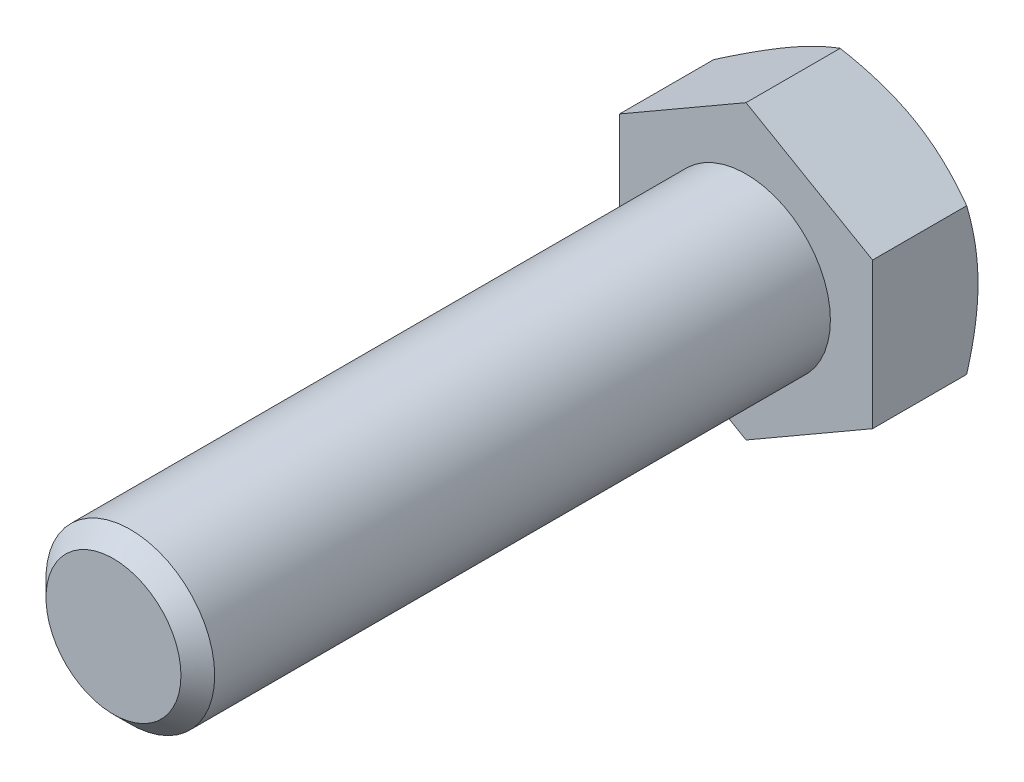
ISO-10303-21;
HEADER;
FILE_DESCRIPTION(('STEP AP214'),'2;1');
FILE_NAME('part.step','',(''),(''),'','','');
FILE_SCHEMA(('AUTOMOTIVE_DESIGN { 1 0 10303 214 1 1 1 1 }'));
ENDSEC;
DATA;
#1=APPLICATION_CONTEXT('core data for automotive mechanical design processes');
#2=APPLICATION_PROTOCOL_DEFINITION('international standard','automotive_design',2000,#1);
#3=PRODUCT_CONTEXT('',#1,'mechanical');
#4=PRODUCT('Part','Part','',(#3));
#5=PRODUCT_RELATED_PRODUCT_CATEGORY('part','',(#4));
#6=PRODUCT_DEFINITION_FORMATION('','',#4);
#7=PRODUCT_DEFINITION_CONTEXT('part definition',#1,'design');
#8=PRODUCT_DEFINITION('design','',#6,#7);
#9=PRODUCT_DEFINITION_SHAPE('','',#8);
#10=(LENGTH_UNIT() NAMED_UNIT(*) SI_UNIT(.MILLI.,.METRE.));
#11=(NAMED_UNIT(*) PLANE_ANGLE_UNIT() SI_UNIT($,.RADIAN.));
#12=(NAMED_UNIT(*) SI_UNIT($,.STERADIAN.) SOLID_ANGLE_UNIT());
#13=UNCERTAINTY_MEASURE_WITH_UNIT(LENGTH_MEASURE(1.E-05),#10,'distance_accuracy_value','');
#14=(GEOMETRIC_REPRESENTATION_CONTEXT(3) GLOBAL_UNCERTAINTY_ASSIGNED_CONTEXT((#13)) GLOBAL_UNIT_ASSIGNED_CONTEXT((#10,
#11,#12)) REPRESENTATION_CONTEXT('',''));
#15=CARTESIAN_POINT('',(0.,0.,0.));
#16=DIRECTION('',(0.,0.,1.));
#17=DIRECTION('',(1.,0.,0.));
#18=AXIS2_PLACEMENT_3D('',#15,#16,#17);
#19=CARTESIAN_POINT('',(-2.22044604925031E-13,1.94289029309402E-13,60.0000000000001));
#20=DIRECTION('',(0.,0.,1.));
#21=DIRECTION('',(1.,0.,0.));
#22=AXIS2_PLACEMENT_3D('',#19,#20,#21);
#23=PLANE('',#22);
#24=CARTESIAN_POINT('',(-2.22044604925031E-13,1.94289029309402E-13,60.0000000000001));
#25=DIRECTION('',(0.,0.,1.));
#26=DIRECTION('',(1.,0.,0.));
#27=AXIS2_PLACEMENT_3D('',#24,#25,#26);
#28=CIRCLE('',#27,6.40000000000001);
#29=CARTESIAN_POINT('',(6.39999999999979,1.90736315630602E-13,60.0000000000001));
#30=VERTEX_POINT('',#29);
#31=EDGE_CURVE('E204',#30,#30,#28,.T.);
#32=ORIENTED_EDGE('',*,*,#31,.T.);
#33=EDGE_LOOP('',(#32));
#34=FACE_BOUND('',#33,.T.);
#35=ADVANCED_FACE('F30',(#34),#23,.T.);
#36=CARTESIAN_POINT('',(0.,0.,0.));
#37=DIRECTION('',(0.,0.,1.));
#38=DIRECTION('',(1.,0.,0.));
#39=AXIS2_PLACEMENT_3D('',#36,#37,#38);
#40=CYLINDRICAL_SURFACE('',#39,8.);
#41=CARTESIAN_POINT('',(-1.11022302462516E-13,1.66533453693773E-13,58.4000000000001));
#42=DIRECTION('',(0.,0.,1.));
#43=DIRECTION('',(1.,0.,0.));
#44=AXIS2_PLACEMENT_3D('',#41,#42,#43);
#45=CIRCLE('',#44,8.);
#46=CARTESIAN_POINT('',(7.99999999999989,1.62092561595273E-13,58.4000000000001));
#47=VERTEX_POINT('',#46);
#48=EDGE_CURVE('E206',#47,#47,#45,.F.);
#49=ORIENTED_EDGE('',*,*,#48,.T.);
#50=EDGE_LOOP('',(#49));
#51=FACE_BOUND('',#50,.T.);
#52=CARTESIAN_POINT('',(0.,0.,0.));
#53=DIRECTION('',(0.,0.,1.));
#54=DIRECTION('',(0.999999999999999,0.,0.));
#55=AXIS2_PLACEMENT_3D('',#52,#53,#54);
#56=CIRCLE('',#55,8.);
#57=CARTESIAN_POINT('',(7.99999999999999,0.,0.));
#58=VERTEX_POINT('',#57);
#59=EDGE_CURVE('E207',#58,#58,#56,.F.);
#60=ORIENTED_EDGE('',*,*,#59,.F.);
#61=EDGE_LOOP('',(#60));
#62=FACE_BOUND('',#61,.T.);
#63=ADVANCED_FACE('F195',(#51,#62),#40,.T.);
#64=CARTESIAN_POINT('',(-2.22044604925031E-13,1.94289029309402E-13,60.0000000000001));
#65=DIRECTION('',(0.,0.,-1.));
#66=DIRECTION('',(-1.,0.,0.));
#67=AXIS2_PLACEMENT_3D('',#64,#65,#66);
#68=CONICAL_SURFACE('',#67,6.40000000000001,0.785398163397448);
#69=ORIENTED_EDGE('',*,*,#48,.F.);
#70=EDGE_LOOP('',(#69));
#71=FACE_BOUND('',#70,.T.);
#72=ORIENTED_EDGE('',*,*,#31,.F.);
#73=EDGE_LOOP('',(#72));
#74=FACE_BOUND('',#73,.T.);
#75=ADVANCED_FACE('F200',(#71,#74),#68,.T.);
#76=CARTESIAN_POINT('',(-2.22044604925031E-13,13.856406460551,-10.0000000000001));
#77=DIRECTION('',(0.499999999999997,0.86602540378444,0.));
#78=DIRECTION('',(-0.866025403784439,0.499999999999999,0.));
#79=AXIS2_PLACEMENT_3D('',#76,#77,#78);
#80=PLANE('',#79);
#81=CARTESIAN_POINT('',(-0.000200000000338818,13.8565219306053,-8.9281365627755));
#82=CARTESIAN_POINT('',(0.263585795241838,13.7042251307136,-9.01605036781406));
#83=CARTESIAN_POINT('',(0.528355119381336,13.5513604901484,-9.09997400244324));
#84=CARTESIAN_POINT('',(1.06001701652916,13.2444053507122,-9.25873378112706));
#85=CARTESIAN_POINT('',(1.32691025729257,13.0903144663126,-9.33356693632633));
#86=CARTESIAN_POINT('',(2.1318904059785,12.6255589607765,-9.54298246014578));
#87=CARTESIAN_POINT('',(2.67315507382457,12.3130596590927,-9.66209676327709));
#88=CARTESIAN_POINT('',(3.48313282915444,11.8454187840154,-9.80176893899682));
#89=CARTESIAN_POINT('',(3.74942610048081,11.6916742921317,-9.84155620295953));
#90=CARTESIAN_POINT('',(4.28324559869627,11.3834734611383,-9.90827663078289));
#91=CARTESIAN_POINT('',(4.5507718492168,11.229017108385,-9.93520954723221));
#92=CARTESIAN_POINT('',(5.08627036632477,10.9198468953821,-9.97553140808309));
#93=CARTESIAN_POINT('',(5.35424172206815,10.7651335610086,-9.98893644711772));
#94=CARTESIAN_POINT('',(5.89043273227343,10.4555635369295,-10.0019169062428));
#95=CARTESIAN_POINT('',(6.15865237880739,10.3007068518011,-10.0014927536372));
#96=CARTESIAN_POINT('',(6.66008937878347,10.0112020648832,-9.98777998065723));
#97=CARTESIAN_POINT('',(6.89334249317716,9.87653331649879,-9.97616401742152));
#98=CARTESIAN_POINT('',(7.35931224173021,9.60750555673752,-9.94269199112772));
#99=CARTESIAN_POINT('',(7.59202883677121,9.47314656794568,-9.92083520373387));
#100=CARTESIAN_POINT('',(8.0567990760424,9.20481134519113,-9.86726258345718));
#101=CARTESIAN_POINT('',(8.28885201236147,9.07083551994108,-9.83553860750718));
#102=CARTESIAN_POINT('',(8.75186996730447,8.80351197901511,-9.76278822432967));
#103=CARTESIAN_POINT('',(8.98283491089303,8.67016430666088,-9.72176118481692));
#104=CARTESIAN_POINT('',(9.68394195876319,8.26537996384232,-9.58368834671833));
#105=CARTESIAN_POINT('',(10.1520537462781,7.99511549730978,-9.47287511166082));
#106=CARTESIAN_POINT('',(11.081297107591,7.45861659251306,-9.22137423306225));
#107=CARTESIAN_POINT('',(11.5424405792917,7.19237528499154,-9.08074565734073));
#108=CARTESIAN_POINT('',(12.0001999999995,6.92808776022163,-8.92813656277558));
#109=B_SPLINE_CURVE_WITH_KNOTS('',3,(#81,#82,#83,#84,#85,#86,#87,#88,#89,#90,#91,#92,#93,#94,
#95,#96,#97,#98,#99,#100,#101,#102,#103,#104,#105,#106,#107,#108),.UNSPECIFIED.,.F.,.F.,(4,2,2,
2,2,2,2,2,2,2,2,2,2,4),(0.,0.951004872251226,1.90232158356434,3.8090046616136,4.73894551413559,
5.66890426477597,6.59775529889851,7.52657763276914,8.33514643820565,9.14377244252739,
9.95306755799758,10.7624176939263,12.4167102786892,14.0677556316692),.UNSPECIFIED.);
#110=CARTESIAN_POINT('',(-1.11022302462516E-13,13.856406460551,-8.92820323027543));
#111=VERTEX_POINT('',#110);
#112=CARTESIAN_POINT('',(5.99999999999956,10.3923048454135,-10.0000000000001));
#113=VERTEX_POINT('',#112);
#114=EDGE_CURVE('E240',#111,#113,#109,.T.);
#115=ORIENTED_EDGE('',*,*,#114,.F.);
#116=DIRECTION('',(0.,0.,1.));
#117=VECTOR('',#116,1.);
#118=CARTESIAN_POINT('',(-2.22044604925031E-13,13.856406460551,-10.0000000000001));
#119=LINE('',#118,#117);
#120=CARTESIAN_POINT('',(0.,13.856406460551,1.11022302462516E-13));
#121=VERTEX_POINT('',#120);
#122=EDGE_CURVE('E214',#111,#121,#119,.T.);
#123=ORIENTED_EDGE('',*,*,#122,.T.);
#124=DIRECTION('',(-0.866025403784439,0.499999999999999,0.));
#125=VECTOR('',#124,1.);
#126=CARTESIAN_POINT('',(0.,13.856406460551,1.11022302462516E-13));
#127=LINE('',#126,#125);
#128=CARTESIAN_POINT('',(11.9999999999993,6.92820323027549,0.));
#129=VERTEX_POINT('',#128);
#130=EDGE_CURVE('E238',#129,#121,#127,.T.);
#131=ORIENTED_EDGE('',*,*,#130,.F.);
#132=DIRECTION('',(0.,0.,1.));
#133=VECTOR('',#132,1.);
#134=CARTESIAN_POINT('',(11.9999999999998,6.92820323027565,-10.0000000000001));
#135=LINE('',#134,#133);
#136=CARTESIAN_POINT('',(11.9999999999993,6.92820323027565,-8.92820323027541));
#137=VERTEX_POINT('',#136);
#138=EDGE_CURVE('E211',#137,#129,#135,.T.);
#139=ORIENTED_EDGE('',*,*,#138,.F.);
#140=EDGE_CURVE('E170',#113,#137,#109,.T.);
#141=ORIENTED_EDGE('',*,*,#140,.F.);
#142=EDGE_LOOP('',(#115,#123,#131,#139,#141));
#143=FACE_BOUND('',#142,.T.);
#144=ADVANCED_FACE('F180',(#143),#80,.T.);
#145=CARTESIAN_POINT('',(11.9999999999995,-6.92820323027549,-10.0000000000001));
#146=DIRECTION('',(0.999999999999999,0.,0.));
#147=DIRECTION('',(0.,0.,-1.));
#148=AXIS2_PLACEMENT_3D('',#145,#146,#147);
#149=PLANE('',#148);
#150=CARTESIAN_POINT('',(11.9999999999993,-18.9250739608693,-3.9904236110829));
#151=CARTESIAN_POINT('',(11.9999999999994,-18.6616294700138,-4.11887459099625));
#152=CARTESIAN_POINT('',(11.9999999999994,-18.3978841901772,-4.24670838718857));
#153=CARTESIAN_POINT('',(11.9999999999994,-17.8697293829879,-4.50100240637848));
#154=CARTESIAN_POINT('',(11.9999999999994,-17.6053198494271,-4.62746261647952));
#155=CARTESIAN_POINT('',(11.9999999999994,-16.8109346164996,-5.00460542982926));
#156=CARTESIAN_POINT('',(11.9999999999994,-16.279875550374,-5.2530143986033));
#157=CARTESIAN_POINT('',(11.9999999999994,-15.2115652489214,-5.74359590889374));
#158=CARTESIAN_POINT('',(11.9999999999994,-14.6742962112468,-5.98572977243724));
#159=CARTESIAN_POINT('',(11.9999999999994,-13.5955935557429,-6.4605025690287));
#160=CARTESIAN_POINT('',(11.9999999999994,-13.0541601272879,-6.69314193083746));
#161=CARTESIAN_POINT('',(11.9999999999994,-11.9477551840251,-7.1541366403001));
#162=CARTESIAN_POINT('',(11.9999999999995,-11.3826097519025,-7.38207667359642));
#163=CARTESIAN_POINT('',(11.9999999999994,-10.2458209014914,-7.82145679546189));
#164=CARTESIAN_POINT('',(11.9999999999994,-9.67417677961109,-8.0328950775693));
#165=CARTESIAN_POINT('',(11.9999999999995,-8.52447018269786,-8.43394793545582));
#166=CARTESIAN_POINT('',(11.9999999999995,-7.94642231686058,-8.62360406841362));
#167=CARTESIAN_POINT('',(11.9999999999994,-6.78198793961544,-8.97522909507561));
#168=CARTESIAN_POINT('',(11.9999999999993,-6.1956040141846,-9.13720638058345));
#169=CARTESIAN_POINT('',(11.9999999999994,-5.31125301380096,-9.35327296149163));
#170=CARTESIAN_POINT('',(11.9999999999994,-5.0165168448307,-9.42065839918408));
#171=CARTESIAN_POINT('',(11.9999999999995,-4.42497462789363,-9.54568693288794));
#172=CARTESIAN_POINT('',(11.9999999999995,-4.12816861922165,-9.60333021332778));
#173=CARTESIAN_POINT('',(11.9999999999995,-3.53266972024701,-9.70787722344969));
#174=CARTESIAN_POINT('',(11.9999999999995,-3.23397688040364,-9.75478123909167));
#175=CARTESIAN_POINT('',(11.9999999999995,-2.63499315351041,-9.83692742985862));
#176=CARTESIAN_POINT('',(11.9999999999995,-2.33470233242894,-9.87217008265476));
#177=CARTESIAN_POINT('',(11.9999999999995,-1.73700046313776,-9.92983318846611));
#178=CARTESIAN_POINT('',(11.9999999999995,-1.43960568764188,-9.9524212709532));
#179=CARTESIAN_POINT('',(11.9999999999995,-0.844126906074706,-9.98498816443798));
#180=CARTESIAN_POINT('',(11.9999999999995,-0.54604291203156,-9.99496719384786));
#181=CARTESIAN_POINT('',(11.9999999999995,0.0502829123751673,-10.0020768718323));
#182=CARTESIAN_POINT('',(11.9999999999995,0.348524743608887,-9.9992074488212));
#183=CARTESIAN_POINT('',(11.9999999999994,0.944614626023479,-9.98069357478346));
#184=CARTESIAN_POINT('',(11.9999999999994,1.24246265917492,-9.96504855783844));
#185=CARTESIAN_POINT('',(11.9999999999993,1.94883669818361,-9.91313385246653));
#186=CARTESIAN_POINT('',(11.9999999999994,2.35696532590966,-9.87132867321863));
#187=CARTESIAN_POINT('',(11.9999999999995,3.17037872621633,-9.76594124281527));
#188=CARTESIAN_POINT('',(11.9999999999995,3.57566314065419,-9.70235629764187));
#189=CARTESIAN_POINT('',(11.9999999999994,4.7866711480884,-9.48228853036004));
#190=CARTESIAN_POINT('',(11.9999999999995,5.58715478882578,-9.296525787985));
#191=CARTESIAN_POINT('',(11.9999999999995,6.78477534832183,-8.97197381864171));
#192=CARTESIAN_POINT('',(11.9999999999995,7.18805346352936,-8.85452170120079));
#193=CARTESIAN_POINT('',(11.9999999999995,7.99069893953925,-8.60681919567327));
#194=CARTESIAN_POINT('',(11.9999999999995,8.39006626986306,-8.47656870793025));
#195=CARTESIAN_POINT('',(11.9999999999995,9.1850074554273,-8.20540698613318));
#196=CARTESIAN_POINT('',(11.9999999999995,9.58058232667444,-8.06449870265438));
#197=CARTESIAN_POINT('',(11.9999999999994,10.3684152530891,-7.77374558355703));
#198=CARTESIAN_POINT('',(11.9999999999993,10.7606733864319,-7.62390095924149));
#199=CARTESIAN_POINT('',(11.9999999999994,11.4875161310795,-7.33823544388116));
#200=CARTESIAN_POINT('',(11.9999999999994,11.8224853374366,-7.20338895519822));
#201=CARTESIAN_POINT('',(11.9999999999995,12.4904657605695,-6.92892402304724));
#202=CARTESIAN_POINT('',(11.9999999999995,12.8234769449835,-6.78930550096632));
#203=CARTESIAN_POINT('',(11.9999999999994,13.8199414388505,-6.36427464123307));
#204=CARTESIAN_POINT('',(11.9999999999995,14.480771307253,-6.07270863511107));
#205=CARTESIAN_POINT('',(11.9999999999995,15.7970784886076,-5.47713534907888));
#206=CARTESIAN_POINT('',(11.9999999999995,16.4525535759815,-5.17312318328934));
#207=CARTESIAN_POINT('',(11.9999999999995,17.7589886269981,-4.555639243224));
#208=CARTESIAN_POINT('',(11.9999999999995,18.4099487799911,-4.24216786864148));
#209=CARTESIAN_POINT('',(11.9999999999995,19.7093218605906,-3.60732416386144));
#210=CARTESIAN_POINT('',(11.9999999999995,20.3577288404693,-3.28593969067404));
#211=CARTESIAN_POINT('',(11.9999999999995,21.6516057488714,-2.63730730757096));
#212=CARTESIAN_POINT('',(11.9999999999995,22.2970756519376,-2.31005934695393));
#213=CARTESIAN_POINT('',(11.9999999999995,23.5854613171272,-1.65093387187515));
#214=CARTESIAN_POINT('',(11.9999999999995,24.2283776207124,-1.31905741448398));
#215=CARTESIAN_POINT('',(11.9999999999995,25.5122149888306,-0.651476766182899));
#216=CARTESIAN_POINT('',(11.9999999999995,26.1531360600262,-0.315772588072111));
#217=CARTESIAN_POINT('',(11.9999999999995,27.936282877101,0.623783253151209));
#218=CARTESIAN_POINT('',(11.9999999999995,29.0767003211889,1.23106608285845));
#219=CARTESIAN_POINT('',(11.9999999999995,31.3537253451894,2.4528894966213));
#220=CARTESIAN_POINT('',(11.9999999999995,32.4903326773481,3.06743054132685));
#221=CARTESIAN_POINT('',(11.9999999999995,34.7567241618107,4.29980771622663));
#222=CARTESIAN_POINT('',(11.9999999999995,35.8865183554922,4.91762539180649));
#223=CARTESIAN_POINT('',(11.9999999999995,37.5794668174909,5.84741408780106));
#224=CARTESIAN_POINT('',(11.9999999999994,38.1434699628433,6.15784153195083));
#225=CARTESIAN_POINT('',(11.9999999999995,39.2709710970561,6.77961088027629));
#226=CARTESIAN_POINT('',(11.9999999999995,39.8344690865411,7.09095278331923));
#227=CARTESIAN_POINT('',(11.9999999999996,40.3977455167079,7.40269511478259));
#228=B_SPLINE_CURVE_WITH_KNOTS('',3,(#150,#151,#152,#153,#154,#155,#156,#157,#158,#159,#160,
#161,#162,#163,#164,#165,#166,#167,#168,#169,#170,#171,#172,#173,#174,#175,#176,#177,#178,#179,
#180,#181,#182,#183,#184,#185,#186,#187,#188,#189,#190,#191,#192,#193,#194,#195,#196,#197,#198,
#199,#200,#201,#202,#203,#204,#205,#206,#207,#208,#209,#210,#211,#212,#213,#214,#215,#216,#217,
#218,#219,#220,#221,#222,#223,#224,#225,#226,#227),.UNSPECIFIED.,.F.,.F.,(4,2,2,2,2,2,2,2,2,2,2,
2,2,2,2,2,2,2,2,2,2,2,2,2,2,2,2,2,2,2,2,2,2,2,2,2,2,2,4),(0.,0.879273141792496,1.75855453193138,
3.51736195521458,5.28522162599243,7.05300137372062,8.88094951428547,10.7090974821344,
12.5336975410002,14.3577434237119,15.2646321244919,16.1715036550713,17.0783510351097,
17.9851612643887,18.8796567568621,19.7741367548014,20.6686217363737,21.5631463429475,
22.7932504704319,24.0235068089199,26.4852023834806,27.7451892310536,29.0051858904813,
30.2648349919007,31.5244543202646,32.6076922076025,33.6909479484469,35.8576349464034,
38.0251808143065,40.1926352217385,42.3636532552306,44.5346900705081,46.7052389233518,
48.8757805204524,52.75183297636,56.6281327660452,60.4911769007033,62.4225443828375,
64.3539094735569),.UNSPECIFIED.);
#229=CARTESIAN_POINT('',(11.9999999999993,4.9960036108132E-13,-9.99999999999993));
#230=VERTEX_POINT('',#229);
#231=EDGE_CURVE('E168',#137,#230,#228,.F.);
#232=ORIENTED_EDGE('',*,*,#231,.F.);
#233=ORIENTED_EDGE('',*,*,#138,.T.);
#234=DIRECTION('',(0.,1.,0.));
#235=VECTOR('',#234,1.);
#236=CARTESIAN_POINT('',(11.9999999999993,-6.92820323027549,0.));
#237=LINE('',#236,#235);
#238=CARTESIAN_POINT('',(11.9999999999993,-6.92820323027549,0.));
#239=VERTEX_POINT('',#238);
#240=EDGE_CURVE('E216',#239,#129,#237,.T.);
#241=ORIENTED_EDGE('',*,*,#240,.F.);
#242=DIRECTION('',(0.,0.,1.));
#243=VECTOR('',#242,1.);
#244=CARTESIAN_POINT('',(11.9999999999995,-6.92820323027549,-10.0000000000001));
#245=LINE('',#244,#243);
#246=CARTESIAN_POINT('',(11.9999999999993,-6.92820323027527,-8.92820323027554));
#247=VERTEX_POINT('',#246);
#248=EDGE_CURVE('E222',#247,#239,#245,.T.);
#249=ORIENTED_EDGE('',*,*,#248,.F.);
#250=EDGE_CURVE('E163',#230,#247,#228,.F.);
#251=ORIENTED_EDGE('',*,*,#250,.F.);
#252=EDGE_LOOP('',(#232,#233,#241,#249,#251));
#253=FACE_BOUND('',#252,.T.);
#254=ADVANCED_FACE('F176',(#253),#149,.T.);
#255=CARTESIAN_POINT('',(-8.88178419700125E-13,-13.8564064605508,-10.));
#256=DIRECTION('',(0.499999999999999,-0.86602540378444,0.));
#257=DIRECTION('',(0.866025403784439,0.499999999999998,0.));
#258=AXIS2_PLACEMENT_3D('',#255,#256,#257);
#259=PLANE('',#258);
#260=CARTESIAN_POINT('',(12.0001999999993,-6.92808776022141,-8.92813656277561));
#261=CARTESIAN_POINT('',(11.7364142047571,-7.08038456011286,-9.01605036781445));
#262=CARTESIAN_POINT('',(11.4716448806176,-7.23324920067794,-9.09997400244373));
#263=CARTESIAN_POINT('',(10.9399829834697,-7.54020434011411,-9.25873378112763));
#264=CARTESIAN_POINT('',(10.6730897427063,-7.69429522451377,-9.33356693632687));
#265=CARTESIAN_POINT('',(9.86810959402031,-8.15905073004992,-9.54298246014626));
#266=CARTESIAN_POINT('',(9.32684492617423,-8.47155003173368,-9.66209676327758));
#267=CARTESIAN_POINT('',(8.51686717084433,-8.939190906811,-9.80176893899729));
#268=CARTESIAN_POINT('',(8.25057389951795,-9.09293539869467,-9.84155620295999));
#269=CARTESIAN_POINT('',(7.71675440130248,-9.40113622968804,-9.90827663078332));
#270=CARTESIAN_POINT('',(7.44922815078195,-9.55559258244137,-9.93520954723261));
#271=CARTESIAN_POINT('',(6.91372963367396,-9.86476279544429,-9.9755314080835));
#272=CARTESIAN_POINT('',(6.64575827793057,-10.0194761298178,-9.98893644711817));
#273=CARTESIAN_POINT('',(6.10956726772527,-10.329046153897,-10.0019169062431));
#274=CARTESIAN_POINT('',(5.8413476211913,-10.4839028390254,-10.0014927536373));
#275=CARTESIAN_POINT('',(5.33991062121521,-10.7734076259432,-9.98777998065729));
#276=CARTESIAN_POINT('',(5.10665750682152,-10.9080763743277,-9.97616401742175));
#277=CARTESIAN_POINT('',(4.64068775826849,-11.1771041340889,-9.94269199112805));
#278=CARTESIAN_POINT('',(4.4079711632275,-11.3114631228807,-9.92083520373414));
#279=CARTESIAN_POINT('',(3.94320092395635,-11.5797983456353,-9.86726258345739));
#280=CARTESIAN_POINT('',(3.71114798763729,-11.7137741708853,-9.83553860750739));
#281=CARTESIAN_POINT('',(3.24813003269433,-11.9810977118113,-9.76278822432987));
#282=CARTESIAN_POINT('',(3.01716508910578,-12.1144453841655,-9.72176118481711));
#283=CARTESIAN_POINT('',(2.31605804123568,-12.519229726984,-9.58368834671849));
#284=CARTESIAN_POINT('',(1.84794625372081,-12.7894941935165,-9.47287511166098));
#285=CARTESIAN_POINT('',(0.91870289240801,-13.3259930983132,-9.22137423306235));
#286=CARTESIAN_POINT('',(0.457559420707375,-13.5922344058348,-9.08074565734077));
#287=CARTESIAN_POINT('',(-0.000200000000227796,-13.8565219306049,-8.92813656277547));
#288=B_SPLINE_CURVE_WITH_KNOTS('',3,(#260,#261,#262,#263,#264,#265,#266,#267,#268,#269,#270,
#271,#272,#273,#274,#275,#276,#277,#278,#279,#280,#281,#282,#283,#284,#285,#286,#287),
.UNSPECIFIED.,.F.,.F.,(4,2,2,2,2,2,2,2,2,2,2,2,2,4),(0.,0.951004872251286,1.90232158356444,
3.80900466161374,4.73894551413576,5.66890426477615,6.59775529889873,7.52657763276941,
8.33514643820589,9.14377244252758,9.95306755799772,10.7624176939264,12.4167102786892,
14.0677556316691),.UNSPECIFIED.);
#289=CARTESIAN_POINT('',(5.99999999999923,-10.3923048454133,-10.));
#290=VERTEX_POINT('',#289);
#291=EDGE_CURVE('E169',#247,#290,#288,.T.);
#292=ORIENTED_EDGE('',*,*,#291,.F.);
#293=ORIENTED_EDGE('',*,*,#248,.T.);
#294=DIRECTION('',(0.866025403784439,0.499999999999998,0.));
#295=VECTOR('',#294,1.);
#296=CARTESIAN_POINT('',(-6.66133814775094E-13,-13.8564064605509,0.));
#297=LINE('',#296,#295);
#298=CARTESIAN_POINT('',(-6.66133814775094E-13,-13.8564064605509,0.));
#299=VERTEX_POINT('',#298);
#300=EDGE_CURVE('E227',#299,#239,#297,.T.);
#301=ORIENTED_EDGE('',*,*,#300,.F.);
#302=DIRECTION('',(0.,0.,1.));
#303=VECTOR('',#302,1.);
#304=CARTESIAN_POINT('',(-8.88178419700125E-13,-13.8564064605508,-10.));
#305=LINE('',#304,#303);
#306=CARTESIAN_POINT('',(-6.66133814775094E-13,-13.8564064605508,-8.92820323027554));
#307=VERTEX_POINT('',#306);
#308=EDGE_CURVE('E220',#307,#299,#305,.T.);
#309=ORIENTED_EDGE('',*,*,#308,.F.);
#310=EDGE_CURVE('E157',#290,#307,#288,.T.);
#311=ORIENTED_EDGE('',*,*,#310,.F.);
#312=EDGE_LOOP('',(#292,#293,#301,#309,#311));
#313=FACE_BOUND('',#312,.T.);
#314=ADVANCED_FACE('F179',(#313),#259,.T.);
#315=CARTESIAN_POINT('',(-8.88178419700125E-13,-13.8564064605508,-10.));
#316=DIRECTION('',(-0.500000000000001,-0.866025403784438,0.));
#317=DIRECTION('',(0.866025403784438,-0.500000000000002,0.));
#318=AXIS2_PLACEMENT_3D('',#315,#316,#317);
#319=PLANE('',#318);
#320=CARTESIAN_POINT('',(0.000199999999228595,-13.8565219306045,-8.9281365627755));
#321=CARTESIAN_POINT('',(-0.263585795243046,-13.7042251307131,-9.01605036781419));
#322=CARTESIAN_POINT('',(-0.528355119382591,-13.551360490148,-9.09997400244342));
#323=CARTESIAN_POINT('',(-1.06001701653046,-13.2444053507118,-9.25873378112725));
#324=CARTESIAN_POINT('',(-1.32691025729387,-13.0903144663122,-9.33356693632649));
#325=CARTESIAN_POINT('',(-2.13189040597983,-12.625558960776,-9.54298246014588));
#326=CARTESIAN_POINT('',(-2.67315507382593,-12.3130596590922,-9.66209676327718));
#327=CARTESIAN_POINT('',(-3.48313282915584,-11.8454187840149,-9.80176893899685));
#328=CARTESIAN_POINT('',(-3.74942610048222,-11.6916742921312,-9.84155620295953));
#329=CARTESIAN_POINT('',(-4.2832455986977,-11.3834734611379,-9.90827663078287));
#330=CARTESIAN_POINT('',(-4.55077184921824,-11.2290171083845,-9.93520954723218));
#331=CARTESIAN_POINT('',(-5.08627036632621,-10.9198468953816,-9.97553140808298));
#332=CARTESIAN_POINT('',(-5.35424172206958,-10.765133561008,-9.98893644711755));
#333=CARTESIAN_POINT('',(-5.89043273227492,-10.455563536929,-10.0019169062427));
#334=CARTESIAN_POINT('',(-6.15865237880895,-10.3007068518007,-10.0014927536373));
#335=CARTESIAN_POINT('',(-6.66008937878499,-10.0112020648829,-9.9877799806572));
#336=CARTESIAN_POINT('',(-6.89334249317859,-9.87653331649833,-9.97616401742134));
#337=CARTESIAN_POINT('',(-7.35931224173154,-9.60750555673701,-9.9426919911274));
#338=CARTESIAN_POINT('',(-7.59202883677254,-9.47314656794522,-9.92083520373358));
#339=CARTESIAN_POINT('',(-8.05679907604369,-9.20481134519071,-9.86726258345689));
#340=CARTESIAN_POINT('',(-8.28885201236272,-9.07083551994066,-9.83553860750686));
#341=CARTESIAN_POINT('',(-8.75186996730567,-8.80351197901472,-9.76278822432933));
#342=CARTESIAN_POINT('',(-8.98283491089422,-8.6701643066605,-9.72176118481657));
#343=CARTESIAN_POINT('',(-9.6839419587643,-8.26537996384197,-9.58368834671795));
#344=CARTESIAN_POINT('',(-10.1520537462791,-7.99511549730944,-9.4728751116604));
#345=CARTESIAN_POINT('',(-11.081297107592,-7.45861659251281,-9.22137423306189));
#346=CARTESIAN_POINT('',(-11.5424405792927,-7.19237528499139,-9.08074565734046));
#347=CARTESIAN_POINT('',(-12.0002000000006,-6.92808776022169,-8.92813656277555));
#348=B_SPLINE_CURVE_WITH_KNOTS('',3,(#320,#321,#322,#323,#324,#325,#326,#327,#328,#329,#330,
#331,#332,#333,#334,#335,#336,#337,#338,#339,#340,#341,#342,#343,#344,#345,#346,#347),
.UNSPECIFIED.,.F.,.F.,(4,2,2,2,2,2,2,2,2,2,2,2,2,4),(0.,0.951004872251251,1.90232158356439,
3.80900466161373,4.73894551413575,5.66890426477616,6.59775529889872,7.52657763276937,
8.33514643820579,9.14377244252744,9.95306755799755,10.7624176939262,12.416710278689,
14.0677556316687),.UNSPECIFIED.);
#349=CARTESIAN_POINT('',(-6.00000000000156,-10.3923048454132,-9.99999999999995));
#350=VERTEX_POINT('',#349);
#351=EDGE_CURVE('E259',#307,#350,#348,.T.);
#352=ORIENTED_EDGE('',*,*,#351,.F.);
#353=ORIENTED_EDGE('',*,*,#308,.T.);
#354=DIRECTION('',(0.866025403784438,-0.500000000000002,0.));
#355=VECTOR('',#354,1.);
#356=CARTESIAN_POINT('',(-6.66133814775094E-13,-13.8564064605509,0.));
#357=LINE('',#356,#355);
#358=CARTESIAN_POINT('',(-12.0000000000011,-6.92820323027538,0.));
#359=VERTEX_POINT('',#358);
#360=EDGE_CURVE('E230',#359,#299,#357,.T.);
#361=ORIENTED_EDGE('',*,*,#360,.F.);
#362=DIRECTION('',(0.,0.,1.));
#363=VECTOR('',#362,1.);
#364=CARTESIAN_POINT('',(-12.0000000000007,-6.92820323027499,-10.));
#365=LINE('',#364,#363);
#366=CARTESIAN_POINT('',(-12.0000000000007,-6.92820323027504,-8.92820323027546));
#367=VERTEX_POINT('',#366);
#368=EDGE_CURVE('E218',#367,#359,#365,.T.);
#369=ORIENTED_EDGE('',*,*,#368,.F.);
#370=EDGE_CURVE('E106',#350,#367,#348,.T.);
#371=ORIENTED_EDGE('',*,*,#370,.F.);
#372=EDGE_LOOP('',(#352,#353,#361,#369,#371));
#373=FACE_BOUND('',#372,.T.);
#374=ADVANCED_FACE('F184',(#373),#319,.T.);
#375=CARTESIAN_POINT('',(-12.0000000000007,-6.92820323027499,-10.));
#376=DIRECTION('',(-0.999999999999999,0.,0.));
#377=DIRECTION('',(0.,0.,1.));
#378=AXIS2_PLACEMENT_3D('',#375,#376,#377);
#379=PLANE('',#378);
#380=CARTESIAN_POINT('',(-12.0000000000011,-18.9250739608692,-3.99042361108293));
#381=CARTESIAN_POINT('',(-12.0000000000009,-18.6616294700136,-4.11887459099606));
#382=CARTESIAN_POINT('',(-12.0000000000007,-18.397884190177,-4.24670838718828));
#383=CARTESIAN_POINT('',(-12.0000000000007,-17.8697293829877,-4.50100240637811));
#384=CARTESIAN_POINT('',(-12.0000000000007,-17.6053198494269,-4.62746261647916));
#385=CARTESIAN_POINT('',(-12.0000000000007,-16.8109346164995,-5.00460542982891));
#386=CARTESIAN_POINT('',(-12.0000000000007,-16.2798755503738,-5.25301439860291));
#387=CARTESIAN_POINT('',(-12.0000000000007,-15.2115652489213,-5.74359590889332));
#388=CARTESIAN_POINT('',(-12.0000000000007,-14.6742962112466,-5.98572977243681));
#389=CARTESIAN_POINT('',(-12.0000000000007,-13.5955935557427,-6.46050256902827));
#390=CARTESIAN_POINT('',(-12.0000000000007,-13.0541601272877,-6.69314193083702));
#391=CARTESIAN_POINT('',(-12.0000000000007,-11.9477551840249,-7.15413664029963));
#392=CARTESIAN_POINT('',(-12.0000000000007,-11.3826097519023,-7.38207667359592));
#393=CARTESIAN_POINT('',(-12.0000000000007,-10.2458209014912,-7.8214567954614));
#394=CARTESIAN_POINT('',(-12.0000000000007,-9.67417677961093,-8.03289507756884));
#395=CARTESIAN_POINT('',(-12.0000000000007,-8.52447018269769,-8.4339479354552));
#396=CARTESIAN_POINT('',(-12.0000000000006,-7.94642231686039,-8.62360406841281));
#397=CARTESIAN_POINT('',(-12.0000000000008,-6.78198793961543,-8.97522909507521));
#398=CARTESIAN_POINT('',(-12.000000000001,-6.19560401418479,-9.13720638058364));
#399=CARTESIAN_POINT('',(-12.0000000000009,-5.31125301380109,-9.35327296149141));
#400=CARTESIAN_POINT('',(-12.0000000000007,-5.01651684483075,-9.42065839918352));
#401=CARTESIAN_POINT('',(-12.0000000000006,-4.42497462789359,-9.54568693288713));
#402=CARTESIAN_POINT('',(-12.0000000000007,-4.12816861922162,-9.60333021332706));
#403=CARTESIAN_POINT('',(-12.0000000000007,-3.53266972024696,-9.70787722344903));
#404=CARTESIAN_POINT('',(-12.0000000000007,-3.23397688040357,-9.75478123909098));
#405=CARTESIAN_POINT('',(-12.0000000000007,-2.63499315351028,-9.83692742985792));
#406=CARTESIAN_POINT('',(-12.0000000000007,-2.33470233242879,-9.87217008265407));
#407=CARTESIAN_POINT('',(-12.0000000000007,-1.73700046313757,-9.92983318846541));
#408=CARTESIAN_POINT('',(-12.0000000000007,-1.43960568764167,-9.95242127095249));
#409=CARTESIAN_POINT('',(-12.0000000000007,-0.84412690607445,-9.98498816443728));
#410=CARTESIAN_POINT('',(-12.0000000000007,-0.546042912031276,-9.99496719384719));
#411=CARTESIAN_POINT('',(-12.0000000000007,0.0502829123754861,-10.0020768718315));
#412=CARTESIAN_POINT('',(-12.0000000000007,0.348524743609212,-9.99920744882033));
#413=CARTESIAN_POINT('',(-12.0000000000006,0.944614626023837,-9.98069357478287));
#414=CARTESIAN_POINT('',(-12.0000000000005,1.2424626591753,-9.96504855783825));
#415=CARTESIAN_POINT('',(-12.0000000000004,1.94883669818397,-9.91313385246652));
#416=CARTESIAN_POINT('',(-12.0000000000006,2.35696532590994,-9.87132867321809));
#417=CARTESIAN_POINT('',(-12.0000000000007,3.17037872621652,-9.76594124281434));
#418=CARTESIAN_POINT('',(-12.0000000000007,3.57566314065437,-9.70235629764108));
#419=CARTESIAN_POINT('',(-12.0000000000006,4.78667114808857,-9.48228853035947));
#420=CARTESIAN_POINT('',(-12.0000000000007,5.58715478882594,-9.29652578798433));
#421=CARTESIAN_POINT('',(-12.0000000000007,6.78477534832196,-8.97197381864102));
#422=CARTESIAN_POINT('',(-12.0000000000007,7.18805346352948,-8.85452170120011));
#423=CARTESIAN_POINT('',(-12.0000000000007,7.99069893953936,-8.60681919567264));
#424=CARTESIAN_POINT('',(-12.0000000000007,8.39006626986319,-8.47656870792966));
#425=CARTESIAN_POINT('',(-12.0000000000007,9.18500745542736,-8.20540698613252));
#426=CARTESIAN_POINT('',(-12.0000000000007,9.58058232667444,-8.06449870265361));
#427=CARTESIAN_POINT('',(-12.0000000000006,10.3684152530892,-7.77374558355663));
#428=CARTESIAN_POINT('',(-12.0000000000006,10.7606733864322,-7.62390095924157));
#429=CARTESIAN_POINT('',(-12.0000000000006,11.4875161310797,-7.33823544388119));
#430=CARTESIAN_POINT('',(-12.0000000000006,11.8224853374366,-7.20338895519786));
#431=CARTESIAN_POINT('',(-12.0000000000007,12.4904657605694,-6.9289240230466));
#432=CARTESIAN_POINT('',(-12.0000000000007,12.8234769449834,-6.7893055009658));
#433=CARTESIAN_POINT('',(-12.0000000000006,13.8199414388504,-6.36427464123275));
#434=CARTESIAN_POINT('',(-12.0000000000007,14.4807713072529,-6.07270863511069));
#435=CARTESIAN_POINT('',(-12.0000000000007,15.7970784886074,-5.47713534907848));
#436=CARTESIAN_POINT('',(-12.0000000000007,16.4525535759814,-5.17312318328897));
#437=CARTESIAN_POINT('',(-12.0000000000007,17.7589886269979,-4.55563924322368));
#438=CARTESIAN_POINT('',(-12.0000000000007,18.4099487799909,-4.24216786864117));
#439=CARTESIAN_POINT('',(-12.0000000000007,19.7093218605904,-3.60732416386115));
#440=CARTESIAN_POINT('',(-12.0000000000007,20.3577288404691,-3.28593969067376));
#441=CARTESIAN_POINT('',(-12.0000000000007,21.6516057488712,-2.6373073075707));
#442=CARTESIAN_POINT('',(-12.0000000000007,22.2970756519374,-2.31005934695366));
#443=CARTESIAN_POINT('',(-12.0000000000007,23.585461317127,-1.6509338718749));
#444=CARTESIAN_POINT('',(-12.0000000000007,24.2283776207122,-1.31905741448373));
#445=CARTESIAN_POINT('',(-12.0000000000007,25.5122149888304,-0.651476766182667));
#446=CARTESIAN_POINT('',(-12.0000000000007,26.153136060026,-0.315772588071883));
#447=CARTESIAN_POINT('',(-12.0000000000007,27.9362828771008,0.62378325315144));
#448=CARTESIAN_POINT('',(-12.0000000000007,29.0767003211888,1.23106608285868));
#449=CARTESIAN_POINT('',(-12.0000000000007,31.3537253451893,2.45288949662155));
#450=CARTESIAN_POINT('',(-12.0000000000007,32.4903326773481,3.06743054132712));
#451=CARTESIAN_POINT('',(-12.0000000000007,34.7567241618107,4.2998077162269));
#452=CARTESIAN_POINT('',(-12.0000000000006,35.8865183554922,4.91762539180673));
#453=CARTESIAN_POINT('',(-12.0000000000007,37.5794668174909,5.84741408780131));
#454=CARTESIAN_POINT('',(-12.0000000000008,38.1434699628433,6.15784153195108));
#455=CARTESIAN_POINT('',(-12.0000000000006,39.2709710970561,6.7796108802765));
#456=CARTESIAN_POINT('',(-12.0000000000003,39.8344690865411,7.09095278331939));
#457=CARTESIAN_POINT('',(-11.9999999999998,40.3977455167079,7.40269511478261));
#458=B_SPLINE_CURVE_WITH_KNOTS('',3,(#380,#381,#382,#383,#384,#385,#386,#387,#388,#389,#390,
#391,#392,#393,#394,#395,#396,#397,#398,#399,#400,#401,#402,#403,#404,#405,#406,#407,#408,#409,
#410,#411,#412,#413,#414,#415,#416,#417,#418,#419,#420,#421,#422,#423,#424,#425,#426,#427,#428,
#429,#430,#431,#432,#433,#434,#435,#436,#437,#438,#439,#440,#441,#442,#443,#444,#445,#446,#447,
#448,#449,#450,#451,#452,#453,#454,#455,#456,#457),.UNSPECIFIED.,.F.,.F.,(4,2,2,2,2,2,2,2,2,2,2,
2,2,2,2,2,2,2,2,2,2,2,2,2,2,2,2,2,2,2,2,2,2,2,2,2,2,2,4),(0.,0.879273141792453,1.75855453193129,
3.51736195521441,5.28522162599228,7.05300137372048,8.88094951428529,10.7090974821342,
12.533697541,14.3577434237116,15.2646321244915,16.171503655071,17.0783510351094,
17.9851612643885,18.8796567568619,19.7741367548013,20.6686217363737,21.5631463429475,
22.7932504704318,24.0235068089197,26.4852023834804,27.7451892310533,29.005185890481,
30.2648349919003,31.5244543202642,32.607692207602,33.6909479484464,35.8576349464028,
38.0251808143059,40.1926352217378,42.3636532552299,44.5346900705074,46.7052389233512,
48.8757805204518,52.7518329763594,56.6281327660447,60.4911769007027,62.422544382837,
64.3539094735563),.UNSPECIFIED.);
#459=CARTESIAN_POINT('',(-12.0000000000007,1.11022302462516E-13,-10.));
#460=VERTEX_POINT('',#459);
#461=EDGE_CURVE('E101',#367,#460,#458,.T.);
#462=ORIENTED_EDGE('',*,*,#461,.F.);
#463=ORIENTED_EDGE('',*,*,#368,.T.);
#464=DIRECTION('',(0.,-1.,0.));
#465=VECTOR('',#464,1.);
#466=CARTESIAN_POINT('',(-12.0000000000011,-6.92820323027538,0.));
#467=LINE('',#466,#465);
#468=CARTESIAN_POINT('',(-12.0000000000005,6.92820323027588,0.));
#469=VERTEX_POINT('',#468);
#470=EDGE_CURVE('E233',#469,#359,#467,.T.);
#471=ORIENTED_EDGE('',*,*,#470,.F.);
#472=DIRECTION('',(0.,0.,1.));
#473=VECTOR('',#472,1.);
#474=CARTESIAN_POINT('',(-12.0000000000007,6.92820323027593,-9.9999999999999));
#475=LINE('',#474,#473);
#476=CARTESIAN_POINT('',(-12.0000000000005,6.92820323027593,-8.92820323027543));
#477=VERTEX_POINT('',#476);
#478=EDGE_CURVE('E127',#477,#469,#475,.T.);
#479=ORIENTED_EDGE('',*,*,#478,.F.);
#480=EDGE_CURVE('E110',#460,#477,#458,.T.);
#481=ORIENTED_EDGE('',*,*,#480,.F.);
#482=EDGE_LOOP('',(#462,#463,#471,#479,#481));
#483=FACE_BOUND('',#482,.T.);
#484=ADVANCED_FACE('F125',(#483),#379,.T.);
#485=CARTESIAN_POINT('',(-12.0000000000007,6.92820323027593,-9.9999999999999));
#486=DIRECTION('',(-0.500000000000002,0.866025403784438,0.));
#487=DIRECTION('',(-0.866025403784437,-0.500000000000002,0.));
#488=AXIS2_PLACEMENT_3D('',#485,#486,#487);
#489=PLANE('',#488);
#490=CARTESIAN_POINT('',(-12.0002000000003,6.92808776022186,-8.92813656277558));
#491=CARTESIAN_POINT('',(-11.7364142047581,7.08038456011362,-9.0160503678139));
#492=CARTESIAN_POINT('',(-11.4716448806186,7.23324920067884,-9.09997400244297));
#493=CARTESIAN_POINT('',(-10.9399829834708,7.5402043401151,-9.25873378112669));
#494=CARTESIAN_POINT('',(-10.6730897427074,7.69429522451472,-9.33356693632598));
#495=CARTESIAN_POINT('',(-9.86810959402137,8.15905073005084,-9.54298246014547));
#496=CARTESIAN_POINT('',(-9.32684492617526,8.47155003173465,-9.66209676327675));
#497=CARTESIAN_POINT('',(-8.51686717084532,8.93919090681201,-9.80176893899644));
#498=CARTESIAN_POINT('',(-8.25057389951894,9.09293539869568,-9.84155620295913));
#499=CARTESIAN_POINT('',(-7.71675440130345,9.40113622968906,-9.9082766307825));
#500=CARTESIAN_POINT('',(-7.44922815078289,9.5555925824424,-9.93520954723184));
#501=CARTESIAN_POINT('',(-6.91372963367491,9.86476279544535,-9.97553140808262));
#502=CARTESIAN_POINT('',(-6.64575827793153,10.0194761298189,-9.98893644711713));
#503=CARTESIAN_POINT('',(-6.1095672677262,10.329046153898,-10.0019169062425));
#504=CARTESIAN_POINT('',(-5.84134762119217,10.4839028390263,-10.0014927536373));
#505=CARTESIAN_POINT('',(-5.33991062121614,10.7734076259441,-9.98777998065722));
#506=CARTESIAN_POINT('',(-5.10665750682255,10.9080763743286,-9.97616401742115));
#507=CARTESIAN_POINT('',(-4.64068775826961,11.1771041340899,-9.94269199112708));
#508=CARTESIAN_POINT('',(-4.40797116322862,11.3114631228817,-9.92083520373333));
#509=CARTESIAN_POINT('',(-3.94320092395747,11.5797983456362,-9.8672625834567));
#510=CARTESIAN_POINT('',(-3.71114798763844,11.7137741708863,-9.83553860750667));
#511=CARTESIAN_POINT('',(-3.24813003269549,11.9810977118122,-9.76278822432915));
#512=CARTESIAN_POINT('',(-3.01716508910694,12.1144453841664,-9.7217611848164));
#513=CARTESIAN_POINT('',(-2.31605804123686,12.519229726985,-9.58368834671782));
#514=CARTESIAN_POINT('',(-1.84794625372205,12.7894941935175,-9.47287511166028));
#515=CARTESIAN_POINT('',(-0.918702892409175,13.3259930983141,-9.22137423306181));
#516=CARTESIAN_POINT('',(-0.457559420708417,13.5922344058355,-9.08074565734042));
#517=CARTESIAN_POINT('',(0.000199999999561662,13.856521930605,-8.92813656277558));
#518=B_SPLINE_CURVE_WITH_KNOTS('',3,(#490,#491,#492,#493,#494,#495,#496,#497,#498,#499,#500,
#501,#502,#503,#504,#505,#506,#507,#508,#509,#510,#511,#512,#513,#514,#515,#516,#517),
.UNSPECIFIED.,.F.,.F.,(4,2,2,2,2,2,2,2,2,2,2,2,2,4),(0.,0.951004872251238,1.90232158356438,
3.8090046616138,4.73894551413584,5.66890426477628,6.59775529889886,7.52657763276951,
8.3351464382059,9.14377244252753,9.95306755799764,10.7624176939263,12.4167102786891,
14.0677556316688),.UNSPECIFIED.);
#519=CARTESIAN_POINT('',(-6.00000000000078,10.3923048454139,-9.99999999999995));
#520=VERTEX_POINT('',#519);
#521=EDGE_CURVE('E116',#477,#520,#518,.T.);
#522=ORIENTED_EDGE('',*,*,#521,.F.);
#523=ORIENTED_EDGE('',*,*,#478,.T.);
#524=DIRECTION('',(-0.866025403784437,-0.500000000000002,0.));
#525=VECTOR('',#524,1.);
#526=CARTESIAN_POINT('',(-12.0000000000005,6.92820323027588,0.));
#527=LINE('',#526,#525);
#528=EDGE_CURVE('E236',#121,#469,#527,.T.);
#529=ORIENTED_EDGE('',*,*,#528,.F.);
#530=ORIENTED_EDGE('',*,*,#122,.F.);
#531=EDGE_CURVE('E118',#520,#111,#518,.T.);
#532=ORIENTED_EDGE('',*,*,#531,.F.);
#533=EDGE_LOOP('',(#522,#523,#529,#530,#532));
#534=FACE_BOUND('',#533,.T.);
#535=ADVANCED_FACE('F192',(#534),#489,.T.);
#536=CARTESIAN_POINT('',(11.9999999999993,6.92820323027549,0.));
#537=DIRECTION('',(0.,0.,1.));
#538=DIRECTION('',(0.999999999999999,0.,0.));
#539=AXIS2_PLACEMENT_3D('',#536,#537,#538);
#540=PLANE('',#539);
#541=ORIENTED_EDGE('',*,*,#59,.T.);
#542=EDGE_LOOP('',(#541));
#543=FACE_BOUND('',#542,.T.);
#544=ORIENTED_EDGE('',*,*,#130,.T.);
#545=ORIENTED_EDGE('',*,*,#528,.T.);
#546=ORIENTED_EDGE('',*,*,#470,.T.);
#547=ORIENTED_EDGE('',*,*,#360,.T.);
#548=ORIENTED_EDGE('',*,*,#300,.T.);
#549=ORIENTED_EDGE('',*,*,#240,.T.);
#550=EDGE_LOOP('',(#544,#545,#546,#547,#548,#549));
#551=FACE_BOUND('',#550,.T.);
#552=ADVANCED_FACE('F149',(#543,#551),#540,.T.);
#553=CARTESIAN_POINT('',(0.,0.,0.));
#554=DIRECTION('',(0.,0.,1.));
#555=DIRECTION('',(1.,0.,0.));
#556=AXIS2_PLACEMENT_3D('',#553,#554,#555);
#557=CONICAL_SURFACE('',#556,29.3205080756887,1.0471975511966);
#558=ORIENTED_EDGE('',*,*,#140,.T.);
#559=ORIENTED_EDGE('',*,*,#231,.T.);
#560=CARTESIAN_POINT('',(0.,0.,-10.0000000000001));
#561=DIRECTION('',(0.,0.,1.));
#562=DIRECTION('',(0.999999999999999,0.,0.));
#563=AXIS2_PLACEMENT_3D('',#560,#561,#562);
#564=CIRCLE('',#563,12.);
#565=EDGE_CURVE('E33',#113,#230,#564,.F.);
#566=ORIENTED_EDGE('',*,*,#565,.F.);
#567=EDGE_LOOP('',(#558,#559,#566));
#568=FACE_BOUND('',#567,.T.);
#569=ADVANCED_FACE('F249',(#568),#557,.T.);
#570=ORIENTED_EDGE('',*,*,#114,.T.);
#571=EDGE_CURVE('E123',#520,#113,#564,.F.);
#572=ORIENTED_EDGE('',*,*,#571,.F.);
#573=ORIENTED_EDGE('',*,*,#531,.T.);
#574=EDGE_LOOP('',(#570,#572,#573));
#575=FACE_BOUND('',#574,.T.);
#576=ADVANCED_FACE('F148',(#575),#557,.T.);
#577=ORIENTED_EDGE('',*,*,#480,.T.);
#578=ORIENTED_EDGE('',*,*,#521,.T.);
#579=CARTESIAN_POINT('',(0.,0.,-10.0000000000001));
#580=DIRECTION('',(0.,0.,-1.));
#581=DIRECTION('',(-1.,0.,0.));
#582=AXIS2_PLACEMENT_3D('',#579,#580,#581);
#583=CIRCLE('',#582,12.);
#584=EDGE_CURVE('E51',#460,#520,#583,.T.);
#585=ORIENTED_EDGE('',*,*,#584,.F.);
#586=EDGE_LOOP('',(#577,#578,#585));
#587=FACE_BOUND('',#586,.T.);
#588=ADVANCED_FACE('F114',(#587),#557,.T.);
#589=ORIENTED_EDGE('',*,*,#370,.T.);
#590=ORIENTED_EDGE('',*,*,#461,.T.);
#591=EDGE_CURVE('E103',#350,#460,#564,.F.);
#592=ORIENTED_EDGE('',*,*,#591,.F.);
#593=EDGE_LOOP('',(#589,#590,#592));
#594=FACE_BOUND('',#593,.T.);
#595=ADVANCED_FACE('F102',(#594),#557,.T.);
#596=ORIENTED_EDGE('',*,*,#310,.T.);
#597=ORIENTED_EDGE('',*,*,#351,.T.);
#598=EDGE_CURVE('E38',#290,#350,#564,.F.);
#599=ORIENTED_EDGE('',*,*,#598,.F.);
#600=EDGE_LOOP('',(#596,#597,#599));
#601=FACE_BOUND('',#600,.T.);
#602=ADVANCED_FACE('F261',(#601),#557,.T.);
#603=ORIENTED_EDGE('',*,*,#250,.T.);
#604=ORIENTED_EDGE('',*,*,#291,.T.);
#605=EDGE_CURVE('E11',#230,#290,#564,.F.);
#606=ORIENTED_EDGE('',*,*,#605,.F.);
#607=EDGE_LOOP('',(#603,#604,#606));
#608=FACE_BOUND('',#607,.T.);
#609=ADVANCED_FACE('F256',(#608),#557,.T.);
#610=CARTESIAN_POINT('',(11.9999999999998,6.92820323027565,-10.0000000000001));
#611=DIRECTION('',(0.,0.,1.));
#612=DIRECTION('',(0.999999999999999,0.,0.));
#613=AXIS2_PLACEMENT_3D('',#610,#611,#612);
#614=PLANE('',#613);
#615=ORIENTED_EDGE('',*,*,#565,.T.);
#616=ORIENTED_EDGE('',*,*,#605,.T.);
#617=ORIENTED_EDGE('',*,*,#598,.T.);
#618=ORIENTED_EDGE('',*,*,#591,.T.);
#619=ORIENTED_EDGE('',*,*,#584,.T.);
#620=ORIENTED_EDGE('',*,*,#571,.T.);
#621=EDGE_LOOP('',(#615,#616,#617,#618,#619,#620));
#622=FACE_BOUND('',#621,.T.);
#623=ADVANCED_FACE('F121',(#622),#614,.F.);
#624=CLOSED_SHELL('',(#35,#63,#75,#144,#254,#314,#374,#484,#535,#552,#569,#576,#588,#595,#602,
#609,#623));
#625=MANIFOLD_SOLID_BREP('B2',#624);
#626=ADVANCED_BREP_SHAPE_REPRESENTATION('',(#18,#625),#14);
#627=SHAPE_DEFINITION_REPRESENTATION(#9,#626);
ENDSEC;
END-ISO-10303-21;
